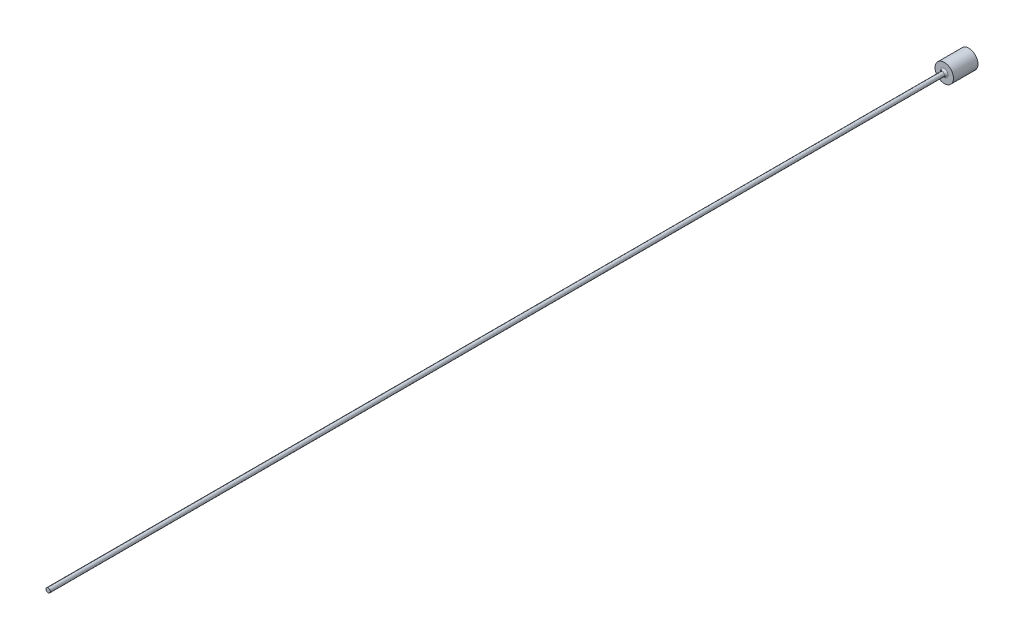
from build123d import *

# Parameters (mm, degrees)
FILLET1_R = 0.3


with BuildPart() as part:
    # FV → Revolve1 (revolve)
    with BuildSketch(Plane(origin=(0, 0, 0), x_dir=(1, 0, 0), z_dir=(0, 1, 0)), mode=Mode.PRIVATE) as revolve1_sk:
        Polygon((0, 0), (1.5, 0), (1.5, -4), (0.35, -4), (0.35, -150), (0, -150), align=None)
    revolve(revolve1_sk.sketch.rotate(Axis((0, 0, -9.033228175), (0, 0, 1)), 180), axis=Axis((0, 0, -9.033228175), (0, 0, 1)))

    # Fillet1
    fillet1_edges = [part.edges().sort_by_distance(p)[0] for p in [
        (0.35, 0, 4),
    ]]
    fillet(fillet1_edges, radius=FILLET1_R)


solid = part.part
